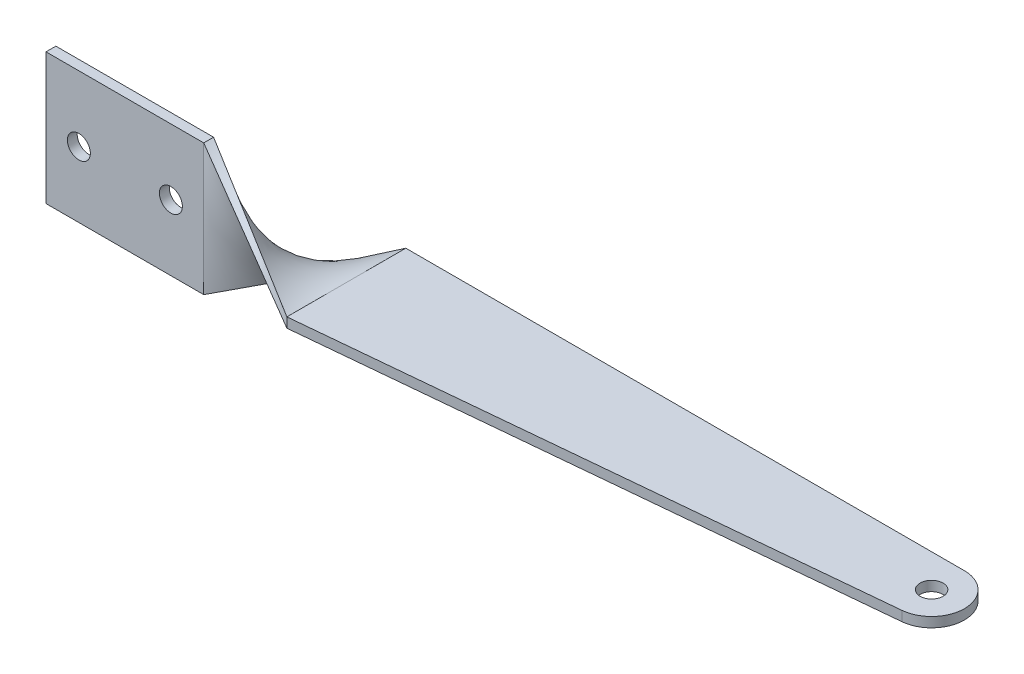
ISO-10303-21;
HEADER;
FILE_DESCRIPTION(('STEP AP214'),'2;1');
FILE_NAME('part.step','',(''),(''),'','','');
FILE_SCHEMA(('AUTOMOTIVE_DESIGN { 1 0 10303 214 1 1 1 1 }'));
ENDSEC;
DATA;
#1=APPLICATION_CONTEXT('core data for automotive mechanical design processes');
#2=APPLICATION_PROTOCOL_DEFINITION('international standard','automotive_design',2000,#1);
#3=PRODUCT_CONTEXT('',#1,'mechanical');
#4=PRODUCT('Part','Part','',(#3));
#5=PRODUCT_RELATED_PRODUCT_CATEGORY('part','',(#4));
#6=PRODUCT_DEFINITION_FORMATION('','',#4);
#7=PRODUCT_DEFINITION_CONTEXT('part definition',#1,'design');
#8=PRODUCT_DEFINITION('design','',#6,#7);
#9=PRODUCT_DEFINITION_SHAPE('','',#8);
#10=(LENGTH_UNIT() NAMED_UNIT(*) SI_UNIT(.MILLI.,.METRE.));
#11=(NAMED_UNIT(*) PLANE_ANGLE_UNIT() SI_UNIT($,.RADIAN.));
#12=(NAMED_UNIT(*) SI_UNIT($,.STERADIAN.) SOLID_ANGLE_UNIT());
#13=UNCERTAINTY_MEASURE_WITH_UNIT(LENGTH_MEASURE(1.E-05),#10,'distance_accuracy_value','');
#14=(GEOMETRIC_REPRESENTATION_CONTEXT(3) GLOBAL_UNCERTAINTY_ASSIGNED_CONTEXT((#13)) GLOBAL_UNIT_ASSIGNED_CONTEXT((#10,
#11,#12)) REPRESENTATION_CONTEXT('',''));
#15=CARTESIAN_POINT('',(0.,0.,0.));
#16=DIRECTION('',(0.,0.,1.));
#17=DIRECTION('',(1.,0.,0.));
#18=AXIS2_PLACEMENT_3D('',#15,#16,#17);
#19=CARTESIAN_POINT('',(-24.,10.,0.75));
#20=DIRECTION('',(0.,0.,1.));
#21=DIRECTION('',(1.,0.,0.));
#22=AXIS2_PLACEMENT_3D('',#19,#20,#21);
#23=PLANE('',#22);
#24=CARTESIAN_POINT('',(-5.,0.,0.75));
#25=DIRECTION('',(0.,0.,1.));
#26=DIRECTION('',(1.,0.,0.));
#27=AXIS2_PLACEMENT_3D('',#24,#25,#26);
#28=CIRCLE('',#27,1.75);
#29=CARTESIAN_POINT('',(-3.25,0.,0.75));
#30=VERTEX_POINT('',#29);
#31=EDGE_CURVE('E292',#30,#30,#28,.T.);
#32=ORIENTED_EDGE('',*,*,#31,.F.);
#33=EDGE_LOOP('',(#32));
#34=FACE_BOUND('',#33,.T.);
#35=DIRECTION('',(-1.,0.,0.));
#36=VECTOR('',#35,1.);
#37=CARTESIAN_POINT('',(0.,10.,0.75));
#38=LINE('',#37,#36);
#39=CARTESIAN_POINT('',(0.,10.,0.75));
#40=VERTEX_POINT('',#39);
#41=CARTESIAN_POINT('',(-24.,10.,0.75));
#42=VERTEX_POINT('',#41);
#43=EDGE_CURVE('E302',#40,#42,#38,.T.);
#44=ORIENTED_EDGE('',*,*,#43,.T.);
#45=DIRECTION('',(0.,-1.,0.));
#46=VECTOR('',#45,1.);
#47=CARTESIAN_POINT('',(-24.,10.,0.75));
#48=LINE('',#47,#46);
#49=CARTESIAN_POINT('',(-24.,-10.,0.75));
#50=VERTEX_POINT('',#49);
#51=EDGE_CURVE('E298',#42,#50,#48,.T.);
#52=ORIENTED_EDGE('',*,*,#51,.T.);
#53=DIRECTION('',(1.,0.,0.));
#54=VECTOR('',#53,1.);
#55=CARTESIAN_POINT('',(0.,-10.,0.75));
#56=LINE('',#55,#54);
#57=CARTESIAN_POINT('',(0.,-10.,0.750000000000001));
#58=VERTEX_POINT('',#57);
#59=EDGE_CURVE('E301',#50,#58,#56,.T.);
#60=ORIENTED_EDGE('',*,*,#59,.T.);
#61=DIRECTION('',(0.,1.,0.));
#62=VECTOR('',#61,1.);
#63=CARTESIAN_POINT('',(0.,10.,0.75));
#64=LINE('',#63,#62);
#65=EDGE_CURVE('E58',#58,#40,#64,.T.);
#66=ORIENTED_EDGE('',*,*,#65,.T.);
#67=EDGE_LOOP('',(#44,#52,#60,#66));
#68=FACE_BOUND('',#67,.T.);
#69=CARTESIAN_POINT('',(-19.,0.,0.75));
#70=DIRECTION('',(0.,0.,1.));
#71=DIRECTION('',(1.,0.,0.));
#72=AXIS2_PLACEMENT_3D('',#69,#70,#71);
#73=CIRCLE('',#72,1.75);
#74=CARTESIAN_POINT('',(-17.25,0.,0.75));
#75=VERTEX_POINT('',#74);
#76=EDGE_CURVE('E286',#75,#75,#73,.T.);
#77=ORIENTED_EDGE('',*,*,#76,.F.);
#78=EDGE_LOOP('',(#77));
#79=FACE_BOUND('',#78,.T.);
#80=ADVANCED_FACE('F38',(#34,#68,#79),#23,.T.);
#81=CARTESIAN_POINT('',(-24.,10.,-0.75));
#82=DIRECTION('',(0.,0.,1.));
#83=DIRECTION('',(1.,0.,0.));
#84=AXIS2_PLACEMENT_3D('',#81,#82,#83);
#85=PLANE('',#84);
#86=CARTESIAN_POINT('',(-5.,0.,-0.75));
#87=DIRECTION('',(0.,0.,1.));
#88=DIRECTION('',(1.,0.,0.));
#89=AXIS2_PLACEMENT_3D('',#86,#87,#88);
#90=CIRCLE('',#89,1.75);
#91=CARTESIAN_POINT('',(-3.25,0.,-0.75));
#92=VERTEX_POINT('',#91);
#93=EDGE_CURVE('E289',#92,#92,#90,.T.);
#94=ORIENTED_EDGE('',*,*,#93,.T.);
#95=EDGE_LOOP('',(#94));
#96=FACE_BOUND('',#95,.T.);
#97=DIRECTION('',(-1.,0.,0.));
#98=VECTOR('',#97,1.);
#99=CARTESIAN_POINT('',(0.,10.,-0.75));
#100=LINE('',#99,#98);
#101=CARTESIAN_POINT('',(0.,10.,-0.75));
#102=VERTEX_POINT('',#101);
#103=CARTESIAN_POINT('',(-24.,10.,-0.75));
#104=VERTEX_POINT('',#103);
#105=EDGE_CURVE('E295',#102,#104,#100,.T.);
#106=ORIENTED_EDGE('',*,*,#105,.F.);
#107=DIRECTION('',(0.,1.,0.));
#108=VECTOR('',#107,1.);
#109=CARTESIAN_POINT('',(0.,10.,-0.75));
#110=LINE('',#109,#108);
#111=CARTESIAN_POINT('',(0.,-10.,-0.750000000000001));
#112=VERTEX_POINT('',#111);
#113=EDGE_CURVE('E307',#112,#102,#110,.T.);
#114=ORIENTED_EDGE('',*,*,#113,.F.);
#115=DIRECTION('',(1.,0.,0.));
#116=VECTOR('',#115,1.);
#117=CARTESIAN_POINT('',(0.,-10.,-0.75));
#118=LINE('',#117,#116);
#119=CARTESIAN_POINT('',(-24.,-10.,-0.75));
#120=VERTEX_POINT('',#119);
#121=EDGE_CURVE('E297',#120,#112,#118,.T.);
#122=ORIENTED_EDGE('',*,*,#121,.F.);
#123=DIRECTION('',(0.,-1.,0.));
#124=VECTOR('',#123,1.);
#125=CARTESIAN_POINT('',(-24.,10.,-0.75));
#126=LINE('',#125,#124);
#127=EDGE_CURVE('E80',#104,#120,#126,.T.);
#128=ORIENTED_EDGE('',*,*,#127,.F.);
#129=EDGE_LOOP('',(#106,#114,#122,#128));
#130=FACE_BOUND('',#129,.T.);
#131=CARTESIAN_POINT('',(-19.,0.,-0.75));
#132=DIRECTION('',(0.,0.,1.));
#133=DIRECTION('',(1.,0.,0.));
#134=AXIS2_PLACEMENT_3D('',#131,#132,#133);
#135=CIRCLE('',#134,1.75);
#136=CARTESIAN_POINT('',(-17.25,0.,-0.75));
#137=VERTEX_POINT('',#136);
#138=EDGE_CURVE('E223',#137,#137,#135,.T.);
#139=ORIENTED_EDGE('',*,*,#138,.T.);
#140=EDGE_LOOP('',(#139));
#141=FACE_BOUND('',#140,.T.);
#142=ADVANCED_FACE('F350',(#96,#130,#141),#85,.F.);
#143=CARTESIAN_POINT('',(0.,10.,0.75));
#144=DIRECTION('',(0.,-1.,0.));
#145=DIRECTION('',(0.,0.,-1.));
#146=AXIS2_PLACEMENT_3D('',#143,#144,#145);
#147=PLANE('',#146);
#148=ORIENTED_EDGE('',*,*,#105,.T.);
#149=DIRECTION('',(0.,0.,-1.));
#150=VECTOR('',#149,1.);
#151=CARTESIAN_POINT('',(-24.,10.,0.75));
#152=LINE('',#151,#150);
#153=EDGE_CURVE('E12',#42,#104,#152,.T.);
#154=ORIENTED_EDGE('',*,*,#153,.F.);
#155=ORIENTED_EDGE('',*,*,#43,.F.);
#156=DIRECTION('',(0.,0.,-1.));
#157=VECTOR('',#156,1.);
#158=CARTESIAN_POINT('',(0.,10.,0.75));
#159=LINE('',#158,#157);
#160=EDGE_CURVE('E71',#40,#102,#159,.T.);
#161=ORIENTED_EDGE('',*,*,#160,.T.);
#162=EDGE_LOOP('',(#148,#154,#155,#161));
#163=FACE_BOUND('',#162,.T.);
#164=ADVANCED_FACE('F40',(#163),#147,.F.);
#165=CARTESIAN_POINT('',(-24.,10.,0.75));
#166=DIRECTION('',(1.,0.,0.));
#167=DIRECTION('',(0.,0.,-1.));
#168=AXIS2_PLACEMENT_3D('',#165,#166,#167);
#169=PLANE('',#168);
#170=ORIENTED_EDGE('',*,*,#127,.T.);
#171=DIRECTION('',(0.,0.,-1.));
#172=VECTOR('',#171,1.);
#173=CARTESIAN_POINT('',(-24.,-10.,0.75));
#174=LINE('',#173,#172);
#175=EDGE_CURVE('E49',#50,#120,#174,.T.);
#176=ORIENTED_EDGE('',*,*,#175,.F.);
#177=ORIENTED_EDGE('',*,*,#51,.F.);
#178=ORIENTED_EDGE('',*,*,#153,.T.);
#179=EDGE_LOOP('',(#170,#176,#177,#178));
#180=FACE_BOUND('',#179,.T.);
#181=ADVANCED_FACE('F358',(#180),#169,.F.);
#182=CARTESIAN_POINT('',(0.,-10.,0.75));
#183=DIRECTION('',(0.,1.,0.));
#184=DIRECTION('',(0.,0.,1.));
#185=AXIS2_PLACEMENT_3D('',#182,#183,#184);
#186=PLANE('',#185);
#187=ORIENTED_EDGE('',*,*,#121,.T.);
#188=DIRECTION('',(0.,0.,1.));
#189=VECTOR('',#188,1.);
#190=CARTESIAN_POINT('',(0.,-10.,0.75));
#191=LINE('',#190,#189);
#192=EDGE_CURVE('E303',#58,#112,#191,.F.);
#193=ORIENTED_EDGE('',*,*,#192,.F.);
#194=ORIENTED_EDGE('',*,*,#59,.F.);
#195=ORIENTED_EDGE('',*,*,#175,.T.);
#196=EDGE_LOOP('',(#187,#193,#194,#195));
#197=FACE_BOUND('',#196,.T.);
#198=ADVANCED_FACE('F348',(#197),#186,.F.);
#199=CARTESIAN_POINT('',(-5.,0.,0.75));
#200=DIRECTION('',(0.,0.,-1.));
#201=DIRECTION('',(-1.,0.,0.));
#202=AXIS2_PLACEMENT_3D('',#199,#200,#201);
#203=CYLINDRICAL_SURFACE('',#202,1.75);
#204=ORIENTED_EDGE('',*,*,#31,.T.);
#205=EDGE_LOOP('',(#204));
#206=FACE_BOUND('',#205,.T.);
#207=ORIENTED_EDGE('',*,*,#93,.F.);
#208=EDGE_LOOP('',(#207));
#209=FACE_BOUND('',#208,.T.);
#210=ADVANCED_FACE('F344',(#206,#209),#203,.F.);
#211=CARTESIAN_POINT('',(-19.,0.,0.75));
#212=DIRECTION('',(0.,0.,-1.));
#213=DIRECTION('',(-1.,0.,0.));
#214=AXIS2_PLACEMENT_3D('',#211,#212,#213);
#215=CYLINDRICAL_SURFACE('',#214,1.75);
#216=ORIENTED_EDGE('',*,*,#76,.T.);
#217=EDGE_LOOP('',(#216));
#218=FACE_BOUND('',#217,.T.);
#219=ORIENTED_EDGE('',*,*,#138,.F.);
#220=EDGE_LOOP('',(#219));
#221=FACE_BOUND('',#220,.T.);
#222=ADVANCED_FACE('F183',(#218,#221),#215,.F.);
#223=CARTESIAN_POINT('',(20.,0.75,8.09976157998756));
#224=CARTESIAN_POINT('',(0.,10.,-0.75));
#225=CARTESIAN_POINT('',(20.,0.75,5.083337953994));
#226=CARTESIAN_POINT('',(0.,6.66666666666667,-0.75));
#227=CARTESIAN_POINT('',(20.,0.75,2.06691432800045));
#228=CARTESIAN_POINT('',(0.,3.33333333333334,-0.75));
#229=CARTESIAN_POINT('',(20.,0.75,-3.96593292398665));
#230=CARTESIAN_POINT('',(0.,-3.33333333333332,-0.75));
#231=CARTESIAN_POINT('',(20.,0.75,-6.9823565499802));
#232=CARTESIAN_POINT('',(0.,-6.66666666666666,-0.75));
#233=CARTESIAN_POINT('',(20.,0.75,-9.99878017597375));
#234=CARTESIAN_POINT('',(0.,-10.,-0.75));
#235=B_SPLINE_SURFACE_WITH_KNOTS('',3,1,((#223,#224),(#225,#226),(#227,#228),(#229,#230),(#231,
#232),(#233,#234)),.UNSPECIFIED.,.F.,.F.,.F.,(4,2,4),(2,2),(0.,0.5,1.),(0.,1.),.UNSPECIFIED.);
#236=DIRECTION('',(0.,0.,-1.));
#237=VECTOR('',#236,1.);
#238=CARTESIAN_POINT('',(20.,0.75,-9.99878017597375));
#239=LINE('',#238,#237);
#240=CARTESIAN_POINT('',(20.,0.75,8.09976157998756));
#241=VERTEX_POINT('',#240);
#242=CARTESIAN_POINT('',(20.,0.75,-9.99878017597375));
#243=VERTEX_POINT('',#242);
#244=EDGE_CURVE('E220',#241,#243,#239,.T.);
#245=DIRECTION('',(-0.815747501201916,-0.43846428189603,0.37723346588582));
#246=VECTOR('',#245,1.);
#247=CARTESIAN_POINT('',(10.,-4.625,-5.37439008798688));
#248=LINE('',#247,#246);
#249=EDGE_CURVE('E147',#243,#112,#248,.T.);
#250=DIRECTION('',(0.842240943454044,-0.389536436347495,0.372681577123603));
#251=VECTOR('',#250,1.);
#252=CARTESIAN_POINT('',(10.,5.375,3.67488078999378));
#253=LINE('',#252,#251);
#254=EDGE_CURVE('E153',#102,#241,#253,.T.);
#255=ORIENTED_EDGE('',*,*,#244,.T.);
#256=ORIENTED_EDGE('',*,*,#249,.T.);
#257=ORIENTED_EDGE('',*,*,#113,.T.);
#258=ORIENTED_EDGE('',*,*,#254,.T.);
#259=EDGE_LOOP('',(#255,#256,#257,#258));
#260=FACE_BOUND('',#259,.T.);
#261=ADVANCED_FACE('F248',(#260),#235,.T.);
#262=CARTESIAN_POINT('',(20.,0.75,-9.99878017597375));
#263=CARTESIAN_POINT('',(0.,-10.,-0.75));
#264=CARTESIAN_POINT('',(20.,0.499999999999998,-9.99878017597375));
#265=CARTESIAN_POINT('',(0.,-10.,-0.499999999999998));
#266=CARTESIAN_POINT('',(20.,0.249999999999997,-9.99878017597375));
#267=CARTESIAN_POINT('',(0.,-10.,-0.249999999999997));
#268=CARTESIAN_POINT('',(20.,-0.250000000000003,-9.99878017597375));
#269=CARTESIAN_POINT('',(0.,-10.,0.250000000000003));
#270=CARTESIAN_POINT('',(20.,-0.500000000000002,-9.99878017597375));
#271=CARTESIAN_POINT('',(0.,-10.,0.500000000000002));
#272=CARTESIAN_POINT('',(20.,-0.75,-9.99878017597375));
#273=CARTESIAN_POINT('',(0.,-10.,0.75));
#274=B_SPLINE_SURFACE_WITH_KNOTS('',3,1,((#262,#263),(#264,#265),(#266,#267),(#268,#269),(#270,
#271),(#272,#273)),.UNSPECIFIED.,.F.,.F.,.F.,(4,2,4),(2,2),(0.,0.5,1.),(0.,1.),.UNSPECIFIED.);
#275=DIRECTION('',(0.,-1.,0.));
#276=VECTOR('',#275,1.);
#277=CARTESIAN_POINT('',(20.,0.75,-9.99878017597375));
#278=LINE('',#277,#276);
#279=CARTESIAN_POINT('',(20.,-0.75,-9.99878017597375));
#280=VERTEX_POINT('',#279);
#281=EDGE_CURVE('E124',#243,#280,#278,.T.);
#282=DIRECTION('',(-0.815749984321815,-0.37728436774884,0.438415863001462));
#283=VECTOR('',#282,1.);
#284=CARTESIAN_POINT('',(10.,-5.375,-4.62439008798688));
#285=LINE('',#284,#283);
#286=EDGE_CURVE('E145',#280,#58,#285,.T.);
#287=ORIENTED_EDGE('',*,*,#281,.T.);
#288=ORIENTED_EDGE('',*,*,#286,.T.);
#289=ORIENTED_EDGE('',*,*,#192,.T.);
#290=ORIENTED_EDGE('',*,*,#249,.F.);
#291=EDGE_LOOP('',(#287,#288,#289,#290));
#292=FACE_BOUND('',#291,.T.);
#293=ADVANCED_FACE('F143',(#292),#274,.T.);
#294=CARTESIAN_POINT('',(20.,-0.75,8.09976157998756));
#295=CARTESIAN_POINT('',(0.,10.,0.75));
#296=CARTESIAN_POINT('',(20.,-0.5,8.09976157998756));
#297=CARTESIAN_POINT('',(0.,10.,0.499999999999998));
#298=CARTESIAN_POINT('',(20.,-0.25,8.09976157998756));
#299=CARTESIAN_POINT('',(0.,10.,0.249999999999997));
#300=CARTESIAN_POINT('',(20.,0.25,8.09976157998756));
#301=CARTESIAN_POINT('',(0.,10.,-0.250000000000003));
#302=CARTESIAN_POINT('',(20.,0.5,8.09976157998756));
#303=CARTESIAN_POINT('',(0.,10.,-0.500000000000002));
#304=CARTESIAN_POINT('',(20.,0.75,8.09976157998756));
#305=CARTESIAN_POINT('',(0.,10.,-0.75));
#306=B_SPLINE_SURFACE_WITH_KNOTS('',3,1,((#294,#295),(#296,#297),(#298,#299),(#300,#301),(#302,
#303),(#304,#305)),.UNSPECIFIED.,.F.,.F.,.F.,(4,2,4),(2,2),(0.,0.5,1.),(0.,1.),.UNSPECIFIED.);
#307=DIRECTION('',(0.,1.,0.));
#308=VECTOR('',#307,1.);
#309=CARTESIAN_POINT('',(20.,0.75,8.09976157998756));
#310=LINE('',#309,#308);
#311=CARTESIAN_POINT('',(20.,-0.75,8.09976157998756));
#312=VERTEX_POINT('',#311);
#313=EDGE_CURVE('E42',#312,#241,#310,.T.);
#314=DIRECTION('',(-0.838015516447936,0.450433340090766,-0.307960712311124));
#315=VECTOR('',#314,1.);
#316=CARTESIAN_POINT('',(10.,4.625,4.42488078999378));
#317=LINE('',#316,#315);
#318=EDGE_CURVE('E154',#312,#40,#317,.T.);
#319=ORIENTED_EDGE('',*,*,#313,.T.);
#320=ORIENTED_EDGE('',*,*,#254,.F.);
#321=ORIENTED_EDGE('',*,*,#160,.F.);
#322=ORIENTED_EDGE('',*,*,#318,.F.);
#323=EDGE_LOOP('',(#319,#320,#321,#322));
#324=FACE_BOUND('',#323,.T.);
#325=ADVANCED_FACE('F182',(#324),#306,.T.);
#326=CARTESIAN_POINT('',(20.,-0.75,-9.99878017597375));
#327=CARTESIAN_POINT('',(0.,-10.,0.75));
#328=CARTESIAN_POINT('',(20.,-0.75,-6.98235654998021));
#329=CARTESIAN_POINT('',(0.,-6.66666666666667,0.75));
#330=CARTESIAN_POINT('',(20.,-0.75,-3.96593292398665));
#331=CARTESIAN_POINT('',(0.,-3.33333333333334,0.75));
#332=CARTESIAN_POINT('',(20.,-0.75,2.06691432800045));
#333=CARTESIAN_POINT('',(0.,3.33333333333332,0.75));
#334=CARTESIAN_POINT('',(20.,-0.75,5.083337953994));
#335=CARTESIAN_POINT('',(0.,6.66666666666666,0.75));
#336=CARTESIAN_POINT('',(20.,-0.75,8.09976157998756));
#337=CARTESIAN_POINT('',(0.,10.,0.75));
#338=B_SPLINE_SURFACE_WITH_KNOTS('',3,1,((#326,#327),(#328,#329),(#330,#331),(#332,#333),(#334,
#335),(#336,#337)),.UNSPECIFIED.,.F.,.F.,.F.,(4,2,4),(2,2),(0.,0.5,1.),(0.,1.),.UNSPECIFIED.);
#339=DIRECTION('',(0.,0.,1.));
#340=VECTOR('',#339,1.);
#341=CARTESIAN_POINT('',(20.,-0.75,-9.99878017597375));
#342=LINE('',#341,#340);
#343=EDGE_CURVE('E110',#280,#312,#342,.T.);
#344=ORIENTED_EDGE('',*,*,#343,.T.);
#345=ORIENTED_EDGE('',*,*,#318,.T.);
#346=ORIENTED_EDGE('',*,*,#65,.F.);
#347=ORIENTED_EDGE('',*,*,#286,.F.);
#348=EDGE_LOOP('',(#344,#345,#346,#347));
#349=FACE_BOUND('',#348,.T.);
#350=ADVANCED_FACE('F152',(#349),#338,.T.);
#351=CARTESIAN_POINT('',(105.000115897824,0.75,-4.99878017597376));
#352=DIRECTION('',(0.,1.,0.));
#353=DIRECTION('',(0.,0.,1.));
#354=AXIS2_PLACEMENT_3D('',#351,#352,#353);
#355=PLANE('',#354);
#356=DIRECTION('',(-1.,0.,0.));
#357=VECTOR('',#356,1.);
#358=CARTESIAN_POINT('',(20.,0.75,-9.99878017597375));
#359=LINE('',#358,#357);
#360=CARTESIAN_POINT('',(105.000115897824,0.75,-9.99878017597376));
#361=VERTEX_POINT('',#360);
#362=EDGE_CURVE('E262',#361,#243,#359,.T.);
#363=ORIENTED_EDGE('',*,*,#362,.T.);
#364=ORIENTED_EDGE('',*,*,#244,.F.);
#365=DIRECTION('',(0.995516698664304,0.,-0.0945859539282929));
#366=VECTOR('',#365,1.);
#367=CARTESIAN_POINT('',(20.,0.75,8.09976157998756));
#368=LINE('',#367,#366);
#369=CARTESIAN_POINT('',(105.473045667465,0.75,-0.0211966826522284));
#370=VERTEX_POINT('',#369);
#371=EDGE_CURVE('E255',#241,#370,#368,.T.);
#372=ORIENTED_EDGE('',*,*,#371,.T.);
#373=CARTESIAN_POINT('',(105.000115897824,0.75,-4.99878017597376));
#374=DIRECTION('',(0.,1.,0.));
#375=DIRECTION('',(0.,0.,1.));
#376=AXIS2_PLACEMENT_3D('',#373,#374,#375);
#377=CIRCLE('',#376,5.);
#378=EDGE_CURVE('E261',#370,#361,#377,.T.);
#379=ORIENTED_EDGE('',*,*,#378,.T.);
#380=EDGE_LOOP('',(#363,#364,#372,#379));
#381=FACE_BOUND('',#380,.T.);
#382=CARTESIAN_POINT('',(105.000115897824,0.75,-4.99878017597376));
#383=DIRECTION('',(0.,1.,0.));
#384=DIRECTION('',(0.,0.,1.));
#385=AXIS2_PLACEMENT_3D('',#382,#383,#384);
#386=CIRCLE('',#385,1.75);
#387=CARTESIAN_POINT('',(105.000115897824,0.75,-3.24878017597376));
#388=VERTEX_POINT('',#387);
#389=EDGE_CURVE('E138',#388,#388,#386,.T.);
#390=ORIENTED_EDGE('',*,*,#389,.F.);
#391=EDGE_LOOP('',(#390));
#392=FACE_BOUND('',#391,.T.);
#393=ADVANCED_FACE('F181',(#381,#392),#355,.T.);
#394=CARTESIAN_POINT('',(105.000115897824,-0.75,-4.99878017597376));
#395=DIRECTION('',(0.,1.,0.));
#396=DIRECTION('',(0.,0.,1.));
#397=AXIS2_PLACEMENT_3D('',#394,#395,#396);
#398=PLANE('',#397);
#399=DIRECTION('',(-1.,0.,0.));
#400=VECTOR('',#399,1.);
#401=CARTESIAN_POINT('',(20.,-0.75,-9.99878017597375));
#402=LINE('',#401,#400);
#403=CARTESIAN_POINT('',(105.000115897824,-0.75,-9.99878017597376));
#404=VERTEX_POINT('',#403);
#405=EDGE_CURVE('E116',#404,#280,#402,.T.);
#406=ORIENTED_EDGE('',*,*,#405,.F.);
#407=CARTESIAN_POINT('',(105.000115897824,-0.75,-4.99878017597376));
#408=DIRECTION('',(0.,1.,0.));
#409=DIRECTION('',(0.,0.,1.));
#410=AXIS2_PLACEMENT_3D('',#407,#408,#409);
#411=CIRCLE('',#410,5.);
#412=CARTESIAN_POINT('',(105.473045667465,-0.75,-0.0211966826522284));
#413=VERTEX_POINT('',#412);
#414=EDGE_CURVE('E265',#413,#404,#411,.T.);
#415=ORIENTED_EDGE('',*,*,#414,.F.);
#416=DIRECTION('',(0.995516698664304,0.,-0.0945859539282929));
#417=VECTOR('',#416,1.);
#418=CARTESIAN_POINT('',(20.,-0.75,8.09976157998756));
#419=LINE('',#418,#417);
#420=EDGE_CURVE('E117',#312,#413,#419,.T.);
#421=ORIENTED_EDGE('',*,*,#420,.F.);
#422=ORIENTED_EDGE('',*,*,#343,.F.);
#423=EDGE_LOOP('',(#406,#415,#421,#422));
#424=FACE_BOUND('',#423,.T.);
#425=CARTESIAN_POINT('',(105.000115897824,-0.75,-4.99878017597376));
#426=DIRECTION('',(0.,1.,0.));
#427=DIRECTION('',(0.,0.,1.));
#428=AXIS2_PLACEMENT_3D('',#425,#426,#427);
#429=CIRCLE('',#428,1.75);
#430=CARTESIAN_POINT('',(105.000115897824,-0.75,-3.24878017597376));
#431=VERTEX_POINT('',#430);
#432=EDGE_CURVE('E487',#431,#431,#429,.T.);
#433=ORIENTED_EDGE('',*,*,#432,.T.);
#434=EDGE_LOOP('',(#433));
#435=FACE_BOUND('',#434,.T.);
#436=ADVANCED_FACE('F113',(#424,#435),#398,.F.);
#437=CARTESIAN_POINT('',(20.,0.75,-9.99878017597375));
#438=DIRECTION('',(0.,0.,1.));
#439=DIRECTION('',(1.,0.,0.));
#440=AXIS2_PLACEMENT_3D('',#437,#438,#439);
#441=PLANE('',#440);
#442=ORIENTED_EDGE('',*,*,#405,.T.);
#443=ORIENTED_EDGE('',*,*,#281,.F.);
#444=ORIENTED_EDGE('',*,*,#362,.F.);
#445=DIRECTION('',(0.,-1.,0.));
#446=VECTOR('',#445,1.);
#447=CARTESIAN_POINT('',(105.000115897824,0.75,-9.99878017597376));
#448=LINE('',#447,#446);
#449=EDGE_CURVE('E137',#361,#404,#448,.T.);
#450=ORIENTED_EDGE('',*,*,#449,.T.);
#451=EDGE_LOOP('',(#442,#443,#444,#450));
#452=FACE_BOUND('',#451,.T.);
#453=ADVANCED_FACE('F132',(#452),#441,.F.);
#454=CARTESIAN_POINT('',(20.,0.75,8.09976157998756));
#455=DIRECTION('',(-0.0945859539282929,0.,-0.995516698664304));
#456=DIRECTION('',(-0.995516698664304,0.,0.0945859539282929));
#457=AXIS2_PLACEMENT_3D('',#454,#455,#456);
#458=PLANE('',#457);
#459=ORIENTED_EDGE('',*,*,#420,.T.);
#460=DIRECTION('',(0.,-1.,0.));
#461=VECTOR('',#460,1.);
#462=CARTESIAN_POINT('',(105.473045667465,0.75,-0.0211966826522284));
#463=LINE('',#462,#461);
#464=EDGE_CURVE('E158',#370,#413,#463,.T.);
#465=ORIENTED_EDGE('',*,*,#464,.F.);
#466=ORIENTED_EDGE('',*,*,#371,.F.);
#467=ORIENTED_EDGE('',*,*,#313,.F.);
#468=EDGE_LOOP('',(#459,#465,#466,#467));
#469=FACE_BOUND('',#468,.T.);
#470=ADVANCED_FACE('F230',(#469),#458,.F.);
#471=CARTESIAN_POINT('',(105.000115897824,0.75,-4.99878017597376));
#472=DIRECTION('',(0.,-1.,0.));
#473=DIRECTION('',(0.,0.,-1.));
#474=AXIS2_PLACEMENT_3D('',#471,#472,#473);
#475=CYLINDRICAL_SURFACE('',#474,5.);
#476=ORIENTED_EDGE('',*,*,#414,.T.);
#477=ORIENTED_EDGE('',*,*,#449,.F.);
#478=ORIENTED_EDGE('',*,*,#378,.F.);
#479=ORIENTED_EDGE('',*,*,#464,.T.);
#480=EDGE_LOOP('',(#476,#477,#478,#479));
#481=FACE_BOUND('',#480,.T.);
#482=ADVANCED_FACE('F239',(#481),#475,.T.);
#483=CARTESIAN_POINT('',(105.000115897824,0.75,-4.99878017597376));
#484=DIRECTION('',(0.,-1.,0.));
#485=DIRECTION('',(0.,0.,-1.));
#486=AXIS2_PLACEMENT_3D('',#483,#484,#485);
#487=CYLINDRICAL_SURFACE('',#486,1.75);
#488=ORIENTED_EDGE('',*,*,#389,.T.);
#489=EDGE_LOOP('',(#488));
#490=FACE_BOUND('',#489,.T.);
#491=ORIENTED_EDGE('',*,*,#432,.F.);
#492=EDGE_LOOP('',(#491));
#493=FACE_BOUND('',#492,.T.);
#494=ADVANCED_FACE('F242',(#490,#493),#487,.F.);
#495=CLOSED_SHELL('',(#80,#142,#164,#181,#198,#210,#222,#261,#293,#325,#350,#393,#436,#453,#470,
#482,#494));
#496=MANIFOLD_SOLID_BREP('B2',#495);
#497=ADVANCED_BREP_SHAPE_REPRESENTATION('',(#18,#496),#14);
#498=SHAPE_DEFINITION_REPRESENTATION(#9,#497);
ENDSEC;
END-ISO-10303-21;
